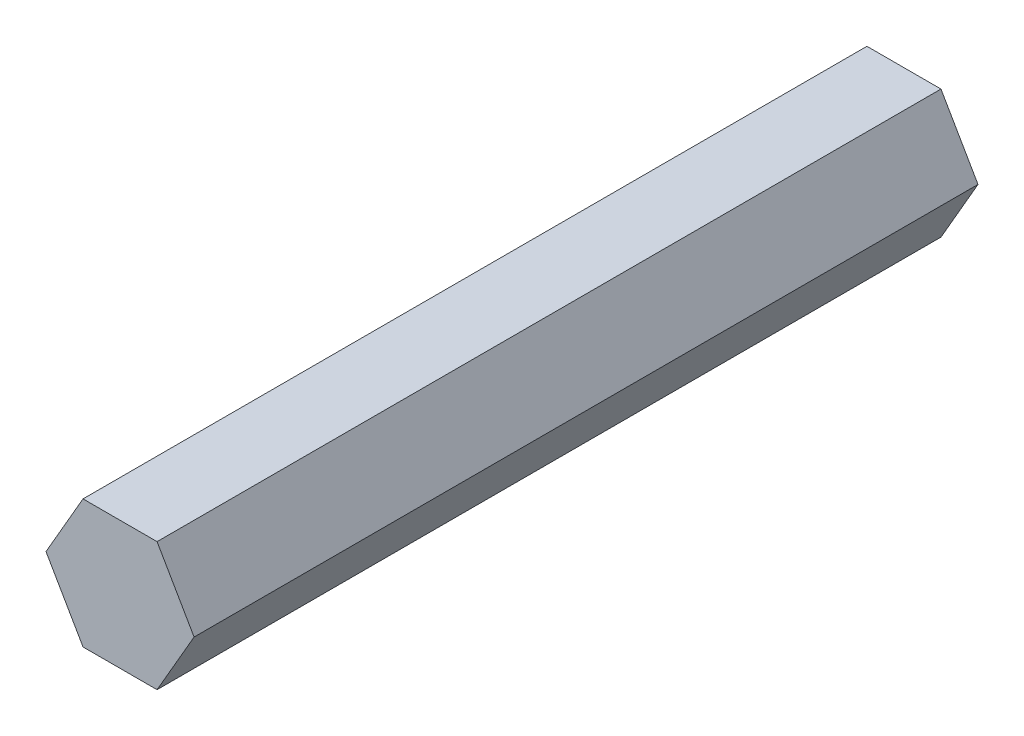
ISO-10303-21;
HEADER;
FILE_DESCRIPTION(('STEP AP214'),'2;1');
FILE_NAME('part.step','',(''),(''),'','','');
FILE_SCHEMA(('AUTOMOTIVE_DESIGN { 1 0 10303 214 1 1 1 1 }'));
ENDSEC;
DATA;
#1=APPLICATION_CONTEXT('core data for automotive mechanical design processes');
#2=APPLICATION_PROTOCOL_DEFINITION('international standard','automotive_design',2000,#1);
#3=PRODUCT_CONTEXT('',#1,'mechanical');
#4=PRODUCT('Part','Part','',(#3));
#5=PRODUCT_RELATED_PRODUCT_CATEGORY('part','',(#4));
#6=PRODUCT_DEFINITION_FORMATION('','',#4);
#7=PRODUCT_DEFINITION_CONTEXT('part definition',#1,'design');
#8=PRODUCT_DEFINITION('design','',#6,#7);
#9=PRODUCT_DEFINITION_SHAPE('','',#8);
#10=(LENGTH_UNIT() NAMED_UNIT(*) SI_UNIT(.MILLI.,.METRE.));
#11=(NAMED_UNIT(*) PLANE_ANGLE_UNIT() SI_UNIT($,.RADIAN.));
#12=(NAMED_UNIT(*) SI_UNIT($,.STERADIAN.) SOLID_ANGLE_UNIT());
#13=UNCERTAINTY_MEASURE_WITH_UNIT(LENGTH_MEASURE(1.E-05),#10,'distance_accuracy_value','');
#14=(GEOMETRIC_REPRESENTATION_CONTEXT(3) GLOBAL_UNCERTAINTY_ASSIGNED_CONTEXT((#13)) GLOBAL_UNIT_ASSIGNED_CONTEXT((#10,
#11,#12)) REPRESENTATION_CONTEXT('',''));
#15=CARTESIAN_POINT('',(0.,0.,0.));
#16=DIRECTION('',(0.,0.,1.));
#17=DIRECTION('',(1.,0.,0.));
#18=AXIS2_PLACEMENT_3D('',#15,#16,#17);
#19=CARTESIAN_POINT('',(0.,0.,-24.45));
#20=DIRECTION('',(0.,0.,-1.));
#21=DIRECTION('',(1.,0.,0.));
#22=AXIS2_PLACEMENT_3D('',#19,#20,#21);
#23=PLANE('',#22);
#24=DIRECTION('',(0.499999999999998,0.86602540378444,0.));
#25=VECTOR('',#24,1.);
#26=CARTESIAN_POINT('',(1.15470053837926,-2.,-24.45));
#27=LINE('',#26,#25);
#28=CARTESIAN_POINT('',(1.15470053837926,-2.,-24.45));
#29=VERTEX_POINT('',#28);
#30=CARTESIAN_POINT('',(2.3094010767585,0.,-24.45));
#31=VERTEX_POINT('',#30);
#32=EDGE_CURVE('E38',#29,#31,#27,.T.);
#33=ORIENTED_EDGE('',*,*,#32,.F.);
#34=DIRECTION('',(1.,0.,0.));
#35=VECTOR('',#34,1.);
#36=CARTESIAN_POINT('',(-1.15470053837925,-2.,-24.45));
#37=LINE('',#36,#35);
#38=CARTESIAN_POINT('',(-1.15470053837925,-2.,-24.45));
#39=VERTEX_POINT('',#38);
#40=EDGE_CURVE('E112',#39,#29,#37,.T.);
#41=ORIENTED_EDGE('',*,*,#40,.F.);
#42=DIRECTION('',(0.499999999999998,-0.86602540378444,0.));
#43=VECTOR('',#42,1.);
#44=CARTESIAN_POINT('',(-2.3094010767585,0.,-24.45));
#45=LINE('',#44,#43);
#46=CARTESIAN_POINT('',(-2.3094010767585,0.,-24.45));
#47=VERTEX_POINT('',#46);
#48=EDGE_CURVE('E116',#47,#39,#45,.T.);
#49=ORIENTED_EDGE('',*,*,#48,.F.);
#50=DIRECTION('',(-0.499999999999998,-0.86602540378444,0.));
#51=VECTOR('',#50,1.);
#52=CARTESIAN_POINT('',(-1.15470053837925,2.,-24.45));
#53=LINE('',#52,#51);
#54=CARTESIAN_POINT('',(-1.15470053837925,2.,-24.45));
#55=VERTEX_POINT('',#54);
#56=EDGE_CURVE('E67',#55,#47,#53,.T.);
#57=ORIENTED_EDGE('',*,*,#56,.F.);
#58=DIRECTION('',(-1.,0.,0.));
#59=VECTOR('',#58,1.);
#60=CARTESIAN_POINT('',(1.15470053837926,2.,-24.45));
#61=LINE('',#60,#59);
#62=CARTESIAN_POINT('',(1.15470053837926,2.,-24.45));
#63=VERTEX_POINT('',#62);
#64=EDGE_CURVE('E72',#63,#55,#61,.T.);
#65=ORIENTED_EDGE('',*,*,#64,.F.);
#66=DIRECTION('',(-0.499999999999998,0.86602540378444,0.));
#67=VECTOR('',#66,1.);
#68=CARTESIAN_POINT('',(2.3094010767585,0.,-24.45));
#69=LINE('',#68,#67);
#70=EDGE_CURVE('E93',#31,#63,#69,.T.);
#71=ORIENTED_EDGE('',*,*,#70,.F.);
#72=EDGE_LOOP('',(#33,#41,#49,#57,#65,#71));
#73=FACE_BOUND('',#72,.T.);
#74=ADVANCED_FACE('F30',(#73),#23,.T.);
#75=CARTESIAN_POINT('',(1.15470053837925,-2.,0.));
#76=DIRECTION('',(0.,0.,-1.));
#77=DIRECTION('',(-1.,0.,0.));
#78=AXIS2_PLACEMENT_3D('',#75,#76,#77);
#79=PLANE('',#78);
#80=DIRECTION('',(0.499999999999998,0.86602540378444,0.));
#81=VECTOR('',#80,1.);
#82=CARTESIAN_POINT('',(1.15470053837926,-2.,0.));
#83=LINE('',#82,#81);
#84=CARTESIAN_POINT('',(1.15470053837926,-2.,0.));
#85=VERTEX_POINT('',#84);
#86=CARTESIAN_POINT('',(2.3094010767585,0.,0.));
#87=VERTEX_POINT('',#86);
#88=EDGE_CURVE('E103',#85,#87,#83,.T.);
#89=ORIENTED_EDGE('',*,*,#88,.T.);
#90=DIRECTION('',(-0.499999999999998,0.86602540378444,0.));
#91=VECTOR('',#90,1.);
#92=CARTESIAN_POINT('',(2.3094010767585,0.,0.));
#93=LINE('',#92,#91);
#94=CARTESIAN_POINT('',(1.15470053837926,2.,0.));
#95=VERTEX_POINT('',#94);
#96=EDGE_CURVE('E91',#87,#95,#93,.T.);
#97=ORIENTED_EDGE('',*,*,#96,.T.);
#98=DIRECTION('',(-1.,0.,0.));
#99=VECTOR('',#98,1.);
#100=CARTESIAN_POINT('',(1.15470053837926,2.,0.));
#101=LINE('',#100,#99);
#102=CARTESIAN_POINT('',(-1.15470053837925,2.,0.));
#103=VERTEX_POINT('',#102);
#104=EDGE_CURVE('E95',#95,#103,#101,.T.);
#105=ORIENTED_EDGE('',*,*,#104,.T.);
#106=DIRECTION('',(-0.499999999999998,-0.86602540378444,0.));
#107=VECTOR('',#106,1.);
#108=CARTESIAN_POINT('',(-1.15470053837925,2.,0.));
#109=LINE('',#108,#107);
#110=CARTESIAN_POINT('',(-2.3094010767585,0.,0.));
#111=VERTEX_POINT('',#110);
#112=EDGE_CURVE('E99',#103,#111,#109,.T.);
#113=ORIENTED_EDGE('',*,*,#112,.T.);
#114=DIRECTION('',(0.499999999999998,-0.86602540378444,0.));
#115=VECTOR('',#114,1.);
#116=CARTESIAN_POINT('',(-2.3094010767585,0.,0.));
#117=LINE('',#116,#115);
#118=CARTESIAN_POINT('',(-1.15470053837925,-2.,0.));
#119=VERTEX_POINT('',#118);
#120=EDGE_CURVE('E131',#111,#119,#117,.T.);
#121=ORIENTED_EDGE('',*,*,#120,.T.);
#122=DIRECTION('',(1.,0.,0.));
#123=VECTOR('',#122,1.);
#124=CARTESIAN_POINT('',(-1.15470053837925,-2.,0.));
#125=LINE('',#124,#123);
#126=EDGE_CURVE('E109',#119,#85,#125,.T.);
#127=ORIENTED_EDGE('',*,*,#126,.T.);
#128=EDGE_LOOP('',(#89,#97,#105,#113,#121,#127));
#129=FACE_BOUND('',#128,.T.);
#130=ADVANCED_FACE('F101',(#129),#79,.F.);
#131=CARTESIAN_POINT('',(2.3094010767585,0.,-30.5601009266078));
#132=DIRECTION('',(0.86602540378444,0.499999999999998,0.));
#133=DIRECTION('',(-0.499999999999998,0.86602540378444,0.));
#134=AXIS2_PLACEMENT_3D('',#131,#132,#133);
#135=PLANE('',#134);
#136=DIRECTION('',(0.,0.,1.));
#137=VECTOR('',#136,1.);
#138=CARTESIAN_POINT('',(2.3094010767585,0.,-30.5601009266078));
#139=LINE('',#138,#137);
#140=EDGE_CURVE('E11',#31,#87,#139,.T.);
#141=ORIENTED_EDGE('',*,*,#140,.F.);
#142=ORIENTED_EDGE('',*,*,#70,.T.);
#143=DIRECTION('',(0.,0.,1.));
#144=VECTOR('',#143,1.);
#145=CARTESIAN_POINT('',(1.15470053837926,2.,-30.5601009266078));
#146=LINE('',#145,#144);
#147=EDGE_CURVE('E88',#63,#95,#146,.T.);
#148=ORIENTED_EDGE('',*,*,#147,.T.);
#149=ORIENTED_EDGE('',*,*,#96,.F.);
#150=EDGE_LOOP('',(#141,#142,#148,#149));
#151=FACE_BOUND('',#150,.T.);
#152=ADVANCED_FACE('F89',(#151),#135,.T.);
#153=CARTESIAN_POINT('',(1.15470053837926,2.,-30.5601009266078));
#154=DIRECTION('',(0.,1.,0.));
#155=DIRECTION('',(-1.,0.,0.));
#156=AXIS2_PLACEMENT_3D('',#153,#154,#155);
#157=PLANE('',#156);
#158=ORIENTED_EDGE('',*,*,#147,.F.);
#159=ORIENTED_EDGE('',*,*,#64,.T.);
#160=DIRECTION('',(0.,0.,1.));
#161=VECTOR('',#160,1.);
#162=CARTESIAN_POINT('',(-1.15470053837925,2.,-30.5601009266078));
#163=LINE('',#162,#161);
#164=EDGE_CURVE('E83',#55,#103,#163,.T.);
#165=ORIENTED_EDGE('',*,*,#164,.T.);
#166=ORIENTED_EDGE('',*,*,#104,.F.);
#167=EDGE_LOOP('',(#158,#159,#165,#166));
#168=FACE_BOUND('',#167,.T.);
#169=ADVANCED_FACE('F96',(#168),#157,.T.);
#170=CARTESIAN_POINT('',(-1.15470053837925,2.,-30.5601009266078));
#171=DIRECTION('',(-0.86602540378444,0.499999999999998,0.));
#172=DIRECTION('',(-0.499999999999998,-0.86602540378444,0.));
#173=AXIS2_PLACEMENT_3D('',#170,#171,#172);
#174=PLANE('',#173);
#175=ORIENTED_EDGE('',*,*,#164,.F.);
#176=ORIENTED_EDGE('',*,*,#56,.T.);
#177=DIRECTION('',(0.,0.,1.));
#178=VECTOR('',#177,1.);
#179=CARTESIAN_POINT('',(-2.3094010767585,0.,-30.5601009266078));
#180=LINE('',#179,#178);
#181=EDGE_CURVE('E119',#47,#111,#180,.T.);
#182=ORIENTED_EDGE('',*,*,#181,.T.);
#183=ORIENTED_EDGE('',*,*,#112,.F.);
#184=EDGE_LOOP('',(#175,#176,#182,#183));
#185=FACE_BOUND('',#184,.T.);
#186=ADVANCED_FACE('F128',(#185),#174,.T.);
#187=CARTESIAN_POINT('',(-2.3094010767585,0.,-30.5601009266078));
#188=DIRECTION('',(-0.86602540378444,-0.499999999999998,0.));
#189=DIRECTION('',(0.499999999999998,-0.86602540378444,0.));
#190=AXIS2_PLACEMENT_3D('',#187,#188,#189);
#191=PLANE('',#190);
#192=ORIENTED_EDGE('',*,*,#181,.F.);
#193=ORIENTED_EDGE('',*,*,#48,.T.);
#194=DIRECTION('',(0.,0.,1.));
#195=VECTOR('',#194,1.);
#196=CARTESIAN_POINT('',(-1.15470053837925,-2.,-30.5601009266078));
#197=LINE('',#196,#195);
#198=EDGE_CURVE('E115',#39,#119,#197,.T.);
#199=ORIENTED_EDGE('',*,*,#198,.T.);
#200=ORIENTED_EDGE('',*,*,#120,.F.);
#201=EDGE_LOOP('',(#192,#193,#199,#200));
#202=FACE_BOUND('',#201,.T.);
#203=ADVANCED_FACE('F132',(#202),#191,.T.);
#204=CARTESIAN_POINT('',(-1.15470053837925,-2.,-30.5601009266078));
#205=DIRECTION('',(0.,-1.,0.));
#206=DIRECTION('',(1.,0.,0.));
#207=AXIS2_PLACEMENT_3D('',#204,#205,#206);
#208=PLANE('',#207);
#209=ORIENTED_EDGE('',*,*,#198,.F.);
#210=ORIENTED_EDGE('',*,*,#40,.T.);
#211=DIRECTION('',(0.,0.,1.));
#212=VECTOR('',#211,1.);
#213=CARTESIAN_POINT('',(1.15470053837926,-2.,-30.5601009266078));
#214=LINE('',#213,#212);
#215=EDGE_CURVE('E111',#29,#85,#214,.T.);
#216=ORIENTED_EDGE('',*,*,#215,.T.);
#217=ORIENTED_EDGE('',*,*,#126,.F.);
#218=EDGE_LOOP('',(#209,#210,#216,#217));
#219=FACE_BOUND('',#218,.T.);
#220=ADVANCED_FACE('F138',(#219),#208,.T.);
#221=CARTESIAN_POINT('',(1.15470053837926,-2.,-30.5601009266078));
#222=DIRECTION('',(0.86602540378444,-0.499999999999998,0.));
#223=DIRECTION('',(0.499999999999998,0.86602540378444,0.));
#224=AXIS2_PLACEMENT_3D('',#221,#222,#223);
#225=PLANE('',#224);
#226=ORIENTED_EDGE('',*,*,#215,.F.);
#227=ORIENTED_EDGE('',*,*,#32,.T.);
#228=ORIENTED_EDGE('',*,*,#140,.T.);
#229=ORIENTED_EDGE('',*,*,#88,.F.);
#230=EDGE_LOOP('',(#226,#227,#228,#229));
#231=FACE_BOUND('',#230,.T.);
#232=ADVANCED_FACE('F140',(#231),#225,.T.);
#233=CLOSED_SHELL('',(#74,#130,#152,#169,#186,#203,#220,#232));
#234=MANIFOLD_SOLID_BREP('B2',#233);
#235=ADVANCED_BREP_SHAPE_REPRESENTATION('',(#18,#234),#14);
#236=SHAPE_DEFINITION_REPRESENTATION(#9,#235);
ENDSEC;
END-ISO-10303-21;
